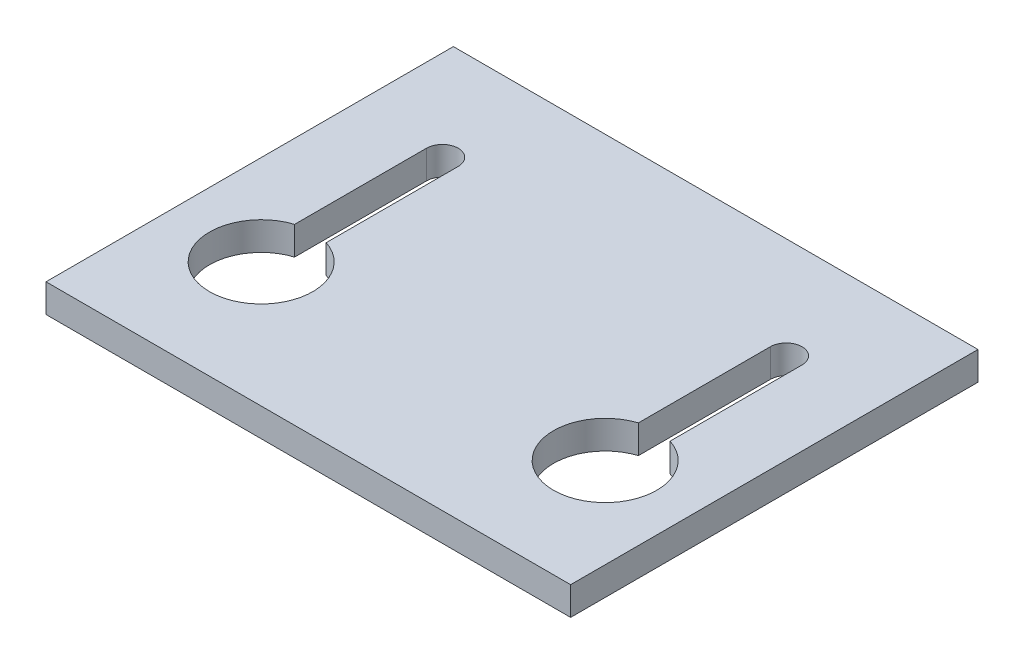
ISO-10303-21;
HEADER;
FILE_DESCRIPTION(('STEP AP214'),'2;1');
FILE_NAME('part.step','',(''),(''),'','','');
FILE_SCHEMA(('AUTOMOTIVE_DESIGN { 1 0 10303 214 1 1 1 1 }'));
ENDSEC;
DATA;
#1=APPLICATION_CONTEXT('core data for automotive mechanical design processes');
#2=APPLICATION_PROTOCOL_DEFINITION('international standard','automotive_design',2000,#1);
#3=PRODUCT_CONTEXT('',#1,'mechanical');
#4=PRODUCT('Part','Part','',(#3));
#5=PRODUCT_RELATED_PRODUCT_CATEGORY('part','',(#4));
#6=PRODUCT_DEFINITION_FORMATION('','',#4);
#7=PRODUCT_DEFINITION_CONTEXT('part definition',#1,'design');
#8=PRODUCT_DEFINITION('design','',#6,#7);
#9=PRODUCT_DEFINITION_SHAPE('','',#8);
#10=(LENGTH_UNIT() NAMED_UNIT(*) SI_UNIT(.MILLI.,.METRE.));
#11=(NAMED_UNIT(*) PLANE_ANGLE_UNIT() SI_UNIT($,.RADIAN.));
#12=(NAMED_UNIT(*) SI_UNIT($,.STERADIAN.) SOLID_ANGLE_UNIT());
#13=UNCERTAINTY_MEASURE_WITH_UNIT(LENGTH_MEASURE(1.E-05),#10,'distance_accuracy_value','');
#14=(GEOMETRIC_REPRESENTATION_CONTEXT(3) GLOBAL_UNCERTAINTY_ASSIGNED_CONTEXT((#13)) GLOBAL_UNIT_ASSIGNED_CONTEXT((#10,
#11,#12)) REPRESENTATION_CONTEXT('',''));
#15=CARTESIAN_POINT('',(0.,0.,0.));
#16=DIRECTION('',(0.,0.,1.));
#17=DIRECTION('',(1.,0.,0.));
#18=AXIS2_PLACEMENT_3D('',#15,#16,#17);
#19=CARTESIAN_POINT('',(0.,7.62,109.439882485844));
#20=DIRECTION('',(0.,1.,0.));
#21=DIRECTION('',(0.,0.,1.));
#22=AXIS2_PLACEMENT_3D('',#19,#20,#21);
#23=PLANE('',#22);
#24=DIRECTION('',(0.,0.,1.));
#25=VECTOR('',#24,1.);
#26=CARTESIAN_POINT('',(0.,7.62,0.));
#27=LINE('',#26,#25);
#28=CARTESIAN_POINT('',(0.,7.62,0.));
#29=VERTEX_POINT('',#28);
#30=CARTESIAN_POINT('',(0.,7.62,109.439882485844));
#31=VERTEX_POINT('',#30);
#32=EDGE_CURVE('E190',#29,#31,#27,.T.);
#33=ORIENTED_EDGE('',*,*,#32,.T.);
#34=DIRECTION('',(1.,0.,0.));
#35=VECTOR('',#34,1.);
#36=CARTESIAN_POINT('',(0.,7.62,109.439882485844));
#37=LINE('',#36,#35);
#38=CARTESIAN_POINT('',(140.940304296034,7.62,109.439882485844));
#39=VERTEX_POINT('',#38);
#40=EDGE_CURVE('E193',#31,#39,#37,.T.);
#41=ORIENTED_EDGE('',*,*,#40,.T.);
#42=DIRECTION('',(0.,0.,-1.));
#43=VECTOR('',#42,1.);
#44=CARTESIAN_POINT('',(140.940304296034,7.62,0.));
#45=LINE('',#44,#43);
#46=CARTESIAN_POINT('',(140.940304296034,7.62,0.));
#47=VERTEX_POINT('',#46);
#48=EDGE_CURVE('E195',#39,#47,#45,.T.);
#49=ORIENTED_EDGE('',*,*,#48,.T.);
#50=DIRECTION('',(-1.,0.,0.));
#51=VECTOR('',#50,1.);
#52=CARTESIAN_POINT('',(0.,7.62,0.));
#53=LINE('',#52,#51);
#54=EDGE_CURVE('E197',#47,#29,#53,.T.);
#55=ORIENTED_EDGE('',*,*,#54,.T.);
#56=EDGE_LOOP('',(#33,#41,#49,#55));
#57=FACE_BOUND('',#56,.T.);
#58=CARTESIAN_POINT('',(24.2843267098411,7.62,27.2480674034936));
#59=DIRECTION('',(0.,1.,0.));
#60=DIRECTION('',(0.,0.,1.));
#61=AXIS2_PLACEMENT_3D('',#58,#59,#60);
#62=CIRCLE('',#61,4.2538353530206);
#63=CARTESIAN_POINT('',(28.5381620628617,7.62,27.2480674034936));
#64=VERTEX_POINT('',#63);
#65=CARTESIAN_POINT('',(20.0304913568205,7.62,27.2480674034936));
#66=VERTEX_POINT('',#65);
#67=EDGE_CURVE('E147',#64,#66,#62,.T.);
#68=ORIENTED_EDGE('',*,*,#67,.F.);
#69=DIRECTION('',(0.,0.,-1.));
#70=VECTOR('',#69,1.);
#71=CARTESIAN_POINT('',(28.5381620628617,7.62,27.2480674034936));
#72=LINE('',#71,#70);
#73=CARTESIAN_POINT('',(28.5381620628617,7.62,62.7032263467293));
#74=VERTEX_POINT('',#73);
#75=EDGE_CURVE('E157',#74,#64,#72,.T.);
#76=ORIENTED_EDGE('',*,*,#75,.F.);
#77=CARTESIAN_POINT('',(24.2609183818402,7.62,75.9030018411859));
#78=DIRECTION('',(0.,1.,0.));
#79=DIRECTION('',(0.,0.,1.));
#80=AXIS2_PLACEMENT_3D('',#77,#78,#79);
#81=CIRCLE('',#80,13.8754778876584);
#82=CARTESIAN_POINT('',(20.0304913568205,7.62,62.688147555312));
#83=VERTEX_POINT('',#82);
#84=EDGE_CURVE('E154',#83,#74,#81,.T.);
#85=ORIENTED_EDGE('',*,*,#84,.F.);
#86=DIRECTION('',(0.,0.,1.));
#87=VECTOR('',#86,1.);
#88=CARTESIAN_POINT('',(20.0304913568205,7.62,27.2480674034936));
#89=LINE('',#88,#87);
#90=EDGE_CURVE('E151',#66,#83,#89,.T.);
#91=ORIENTED_EDGE('',*,*,#90,.F.);
#92=EDGE_LOOP('',(#68,#76,#85,#91));
#93=FACE_BOUND('',#92,.T.);
#94=DIRECTION('',(0.,0.,-1.));
#95=VECTOR('',#94,1.);
#96=CARTESIAN_POINT('',(112.402142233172,7.62,27.2480674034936));
#97=LINE('',#96,#95);
#98=CARTESIAN_POINT('',(112.402142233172,7.62,62.7032263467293));
#99=VERTEX_POINT('',#98);
#100=CARTESIAN_POINT('',(112.402142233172,7.62,27.2480674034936));
#101=VERTEX_POINT('',#100);
#102=EDGE_CURVE('E129',#99,#101,#97,.T.);
#103=ORIENTED_EDGE('',*,*,#102,.T.);
#104=CARTESIAN_POINT('',(116.655977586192,7.62,27.2480674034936));
#105=DIRECTION('',(0.,-1.,0.));
#106=DIRECTION('',(0.,0.,1.));
#107=AXIS2_PLACEMENT_3D('',#104,#105,#106);
#108=CIRCLE('',#107,4.2538353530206);
#109=CARTESIAN_POINT('',(120.909812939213,7.62,27.2480674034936));
#110=VERTEX_POINT('',#109);
#111=EDGE_CURVE('E42',#101,#110,#108,.T.);
#112=ORIENTED_EDGE('',*,*,#111,.T.);
#113=DIRECTION('',(0.,0.,1.));
#114=VECTOR('',#113,1.);
#115=CARTESIAN_POINT('',(120.909812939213,7.62,27.2480674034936));
#116=LINE('',#115,#114);
#117=CARTESIAN_POINT('',(120.909812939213,7.62,62.688147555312));
#118=VERTEX_POINT('',#117);
#119=EDGE_CURVE('E133',#110,#118,#116,.T.);
#120=ORIENTED_EDGE('',*,*,#119,.T.);
#121=CARTESIAN_POINT('',(116.679385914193,7.62,75.9030018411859));
#122=DIRECTION('',(0.,-1.,0.));
#123=DIRECTION('',(0.,0.,1.));
#124=AXIS2_PLACEMENT_3D('',#121,#122,#123);
#125=CIRCLE('',#124,13.8754778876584);
#126=EDGE_CURVE('E120',#118,#99,#125,.T.);
#127=ORIENTED_EDGE('',*,*,#126,.T.);
#128=EDGE_LOOP('',(#103,#112,#120,#127));
#129=FACE_BOUND('',#128,.T.);
#130=ADVANCED_FACE('F27',(#57,#93,#129),#23,.T.);
#131=CARTESIAN_POINT('',(0.,0.,109.439882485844));
#132=DIRECTION('',(0.,1.,0.));
#133=DIRECTION('',(0.,0.,1.));
#134=AXIS2_PLACEMENT_3D('',#131,#132,#133);
#135=PLANE('',#134);
#136=DIRECTION('',(0.,0.,1.));
#137=VECTOR('',#136,1.);
#138=CARTESIAN_POINT('',(0.,0.,0.));
#139=LINE('',#138,#137);
#140=CARTESIAN_POINT('',(0.,0.,0.));
#141=VERTEX_POINT('',#140);
#142=CARTESIAN_POINT('',(0.,0.,109.439882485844));
#143=VERTEX_POINT('',#142);
#144=EDGE_CURVE('E175',#141,#143,#139,.T.);
#145=ORIENTED_EDGE('',*,*,#144,.F.);
#146=DIRECTION('',(-1.,0.,0.));
#147=VECTOR('',#146,1.);
#148=CARTESIAN_POINT('',(0.,0.,0.));
#149=LINE('',#148,#147);
#150=CARTESIAN_POINT('',(140.940304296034,0.,0.));
#151=VERTEX_POINT('',#150);
#152=EDGE_CURVE('E188',#151,#141,#149,.T.);
#153=ORIENTED_EDGE('',*,*,#152,.F.);
#154=DIRECTION('',(0.,0.,-1.));
#155=VECTOR('',#154,1.);
#156=CARTESIAN_POINT('',(140.940304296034,0.,0.));
#157=LINE('',#156,#155);
#158=CARTESIAN_POINT('',(140.940304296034,0.,109.439882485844));
#159=VERTEX_POINT('',#158);
#160=EDGE_CURVE('E186',#159,#151,#157,.T.);
#161=ORIENTED_EDGE('',*,*,#160,.F.);
#162=DIRECTION('',(1.,0.,0.));
#163=VECTOR('',#162,1.);
#164=CARTESIAN_POINT('',(0.,0.,109.439882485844));
#165=LINE('',#164,#163);
#166=EDGE_CURVE('E184',#143,#159,#165,.T.);
#167=ORIENTED_EDGE('',*,*,#166,.F.);
#168=EDGE_LOOP('',(#145,#153,#161,#167));
#169=FACE_BOUND('',#168,.T.);
#170=DIRECTION('',(0.,0.,-1.));
#171=VECTOR('',#170,1.);
#172=CARTESIAN_POINT('',(28.5381620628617,0.,27.2480674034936));
#173=LINE('',#172,#171);
#174=CARTESIAN_POINT('',(28.5381620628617,0.,62.7032263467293));
#175=VERTEX_POINT('',#174);
#176=CARTESIAN_POINT('',(28.5381620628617,0.,27.2480674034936));
#177=VERTEX_POINT('',#176);
#178=EDGE_CURVE('E169',#175,#177,#173,.T.);
#179=ORIENTED_EDGE('',*,*,#178,.T.);
#180=CARTESIAN_POINT('',(24.2843267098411,0.,27.2480674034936));
#181=DIRECTION('',(0.,1.,0.));
#182=DIRECTION('',(0.,0.,1.));
#183=AXIS2_PLACEMENT_3D('',#180,#181,#182);
#184=CIRCLE('',#183,4.2538353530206);
#185=CARTESIAN_POINT('',(20.0304913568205,0.,27.2480674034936));
#186=VERTEX_POINT('',#185);
#187=EDGE_CURVE('E160',#177,#186,#184,.T.);
#188=ORIENTED_EDGE('',*,*,#187,.T.);
#189=DIRECTION('',(0.,0.,1.));
#190=VECTOR('',#189,1.);
#191=CARTESIAN_POINT('',(20.0304913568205,0.,27.2480674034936));
#192=LINE('',#191,#190);
#193=CARTESIAN_POINT('',(20.0304913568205,0.,62.688147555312));
#194=VERTEX_POINT('',#193);
#195=EDGE_CURVE('E163',#186,#194,#192,.T.);
#196=ORIENTED_EDGE('',*,*,#195,.T.);
#197=CARTESIAN_POINT('',(24.2609183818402,0.,75.9030018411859));
#198=DIRECTION('',(0.,1.,0.));
#199=DIRECTION('',(0.,0.,1.));
#200=AXIS2_PLACEMENT_3D('',#197,#198,#199);
#201=CIRCLE('',#200,13.8754778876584);
#202=EDGE_CURVE('E166',#194,#175,#201,.T.);
#203=ORIENTED_EDGE('',*,*,#202,.T.);
#204=EDGE_LOOP('',(#179,#188,#196,#203));
#205=FACE_BOUND('',#204,.T.);
#206=CARTESIAN_POINT('',(116.655977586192,0.,27.2480674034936));
#207=DIRECTION('',(0.,-1.,0.));
#208=DIRECTION('',(0.,0.,1.));
#209=AXIS2_PLACEMENT_3D('',#206,#207,#208);
#210=CIRCLE('',#209,4.2538353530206);
#211=CARTESIAN_POINT('',(112.402142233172,0.,27.2480674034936));
#212=VERTEX_POINT('',#211);
#213=CARTESIAN_POINT('',(120.909812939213,0.,27.2480674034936));
#214=VERTEX_POINT('',#213);
#215=EDGE_CURVE('E135',#212,#214,#210,.T.);
#216=ORIENTED_EDGE('',*,*,#215,.F.);
#217=DIRECTION('',(0.,0.,-1.));
#218=VECTOR('',#217,1.);
#219=CARTESIAN_POINT('',(112.402142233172,0.,27.2480674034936));
#220=LINE('',#219,#218);
#221=CARTESIAN_POINT('',(112.402142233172,0.,62.7032263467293));
#222=VERTEX_POINT('',#221);
#223=EDGE_CURVE('E140',#222,#212,#220,.T.);
#224=ORIENTED_EDGE('',*,*,#223,.F.);
#225=CARTESIAN_POINT('',(116.679385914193,0.,75.9030018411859));
#226=DIRECTION('',(0.,-1.,0.));
#227=DIRECTION('',(0.,0.,1.));
#228=AXIS2_PLACEMENT_3D('',#225,#226,#227);
#229=CIRCLE('',#228,13.8754778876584);
#230=CARTESIAN_POINT('',(120.909812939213,0.,62.688147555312));
#231=VERTEX_POINT('',#230);
#232=EDGE_CURVE('E123',#231,#222,#229,.T.);
#233=ORIENTED_EDGE('',*,*,#232,.F.);
#234=DIRECTION('',(0.,0.,1.));
#235=VECTOR('',#234,1.);
#236=CARTESIAN_POINT('',(120.909812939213,0.,27.2480674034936));
#237=LINE('',#236,#235);
#238=EDGE_CURVE('E143',#214,#231,#237,.T.);
#239=ORIENTED_EDGE('',*,*,#238,.F.);
#240=EDGE_LOOP('',(#216,#224,#233,#239));
#241=FACE_BOUND('',#240,.T.);
#242=ADVANCED_FACE('F215',(#169,#205,#241),#135,.F.);
#243=CARTESIAN_POINT('',(0.,7.62,0.));
#244=DIRECTION('',(1.,0.,0.));
#245=DIRECTION('',(0.,0.,-1.));
#246=AXIS2_PLACEMENT_3D('',#243,#244,#245);
#247=PLANE('',#246);
#248=ORIENTED_EDGE('',*,*,#144,.T.);
#249=DIRECTION('',(0.,-1.,0.));
#250=VECTOR('',#249,1.);
#251=CARTESIAN_POINT('',(0.,7.62,109.439882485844));
#252=LINE('',#251,#250);
#253=EDGE_CURVE('E11',#31,#143,#252,.T.);
#254=ORIENTED_EDGE('',*,*,#253,.F.);
#255=ORIENTED_EDGE('',*,*,#32,.F.);
#256=DIRECTION('',(0.,-1.,0.));
#257=VECTOR('',#256,1.);
#258=CARTESIAN_POINT('',(0.,7.62,0.));
#259=LINE('',#258,#257);
#260=EDGE_CURVE('E199',#29,#141,#259,.T.);
#261=ORIENTED_EDGE('',*,*,#260,.T.);
#262=EDGE_LOOP('',(#248,#254,#255,#261));
#263=FACE_BOUND('',#262,.T.);
#264=ADVANCED_FACE('F29',(#263),#247,.F.);
#265=CARTESIAN_POINT('',(0.,7.62,109.439882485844));
#266=DIRECTION('',(0.,0.,-1.));
#267=DIRECTION('',(-1.,0.,0.));
#268=AXIS2_PLACEMENT_3D('',#265,#266,#267);
#269=PLANE('',#268);
#270=ORIENTED_EDGE('',*,*,#166,.T.);
#271=DIRECTION('',(0.,-1.,0.));
#272=VECTOR('',#271,1.);
#273=CARTESIAN_POINT('',(140.940304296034,7.62,109.439882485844));
#274=LINE('',#273,#272);
#275=EDGE_CURVE('E35',#39,#159,#274,.T.);
#276=ORIENTED_EDGE('',*,*,#275,.F.);
#277=ORIENTED_EDGE('',*,*,#40,.F.);
#278=ORIENTED_EDGE('',*,*,#253,.T.);
#279=EDGE_LOOP('',(#270,#276,#277,#278));
#280=FACE_BOUND('',#279,.T.);
#281=ADVANCED_FACE('F226',(#280),#269,.F.);
#282=CARTESIAN_POINT('',(140.940304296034,7.62,0.));
#283=DIRECTION('',(-1.,0.,0.));
#284=DIRECTION('',(0.,0.,1.));
#285=AXIS2_PLACEMENT_3D('',#282,#283,#284);
#286=PLANE('',#285);
#287=ORIENTED_EDGE('',*,*,#160,.T.);
#288=DIRECTION('',(0.,-1.,0.));
#289=VECTOR('',#288,1.);
#290=CARTESIAN_POINT('',(140.940304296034,7.62,0.));
#291=LINE('',#290,#289);
#292=EDGE_CURVE('E202',#47,#151,#291,.T.);
#293=ORIENTED_EDGE('',*,*,#292,.F.);
#294=ORIENTED_EDGE('',*,*,#48,.F.);
#295=ORIENTED_EDGE('',*,*,#275,.T.);
#296=EDGE_LOOP('',(#287,#293,#294,#295));
#297=FACE_BOUND('',#296,.T.);
#298=ADVANCED_FACE('F209',(#297),#286,.F.);
#299=CARTESIAN_POINT('',(0.,7.62,0.));
#300=DIRECTION('',(0.,0.,1.));
#301=DIRECTION('',(1.,0.,0.));
#302=AXIS2_PLACEMENT_3D('',#299,#300,#301);
#303=PLANE('',#302);
#304=ORIENTED_EDGE('',*,*,#152,.T.);
#305=ORIENTED_EDGE('',*,*,#260,.F.);
#306=ORIENTED_EDGE('',*,*,#54,.F.);
#307=ORIENTED_EDGE('',*,*,#292,.T.);
#308=EDGE_LOOP('',(#304,#305,#306,#307));
#309=FACE_BOUND('',#308,.T.);
#310=ADVANCED_FACE('F219',(#309),#303,.F.);
#311=CARTESIAN_POINT('',(24.2843267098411,0.,27.2480674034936));
#312=DIRECTION('',(0.,1.,0.));
#313=DIRECTION('',(0.,0.,1.));
#314=AXIS2_PLACEMENT_3D('',#311,#312,#313);
#315=CYLINDRICAL_SURFACE('',#314,4.2538353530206);
#316=ORIENTED_EDGE('',*,*,#67,.T.);
#317=DIRECTION('',(0.,1.,0.));
#318=VECTOR('',#317,1.);
#319=CARTESIAN_POINT('',(20.0304913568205,0.,27.2480674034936));
#320=LINE('',#319,#318);
#321=EDGE_CURVE('E172',#186,#66,#320,.T.);
#322=ORIENTED_EDGE('',*,*,#321,.F.);
#323=ORIENTED_EDGE('',*,*,#187,.F.);
#324=DIRECTION('',(0.,1.,0.));
#325=VECTOR('',#324,1.);
#326=CARTESIAN_POINT('',(28.5381620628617,0.,27.2480674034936));
#327=LINE('',#326,#325);
#328=EDGE_CURVE('E173',#177,#64,#327,.T.);
#329=ORIENTED_EDGE('',*,*,#328,.T.);
#330=EDGE_LOOP('',(#316,#322,#323,#329));
#331=FACE_BOUND('',#330,.T.);
#332=ADVANCED_FACE('F243',(#331),#315,.F.);
#333=CARTESIAN_POINT('',(28.5381620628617,0.,27.2480674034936));
#334=DIRECTION('',(1.,0.,0.));
#335=DIRECTION('',(0.,0.,-1.));
#336=AXIS2_PLACEMENT_3D('',#333,#334,#335);
#337=PLANE('',#336);
#338=ORIENTED_EDGE('',*,*,#75,.T.);
#339=ORIENTED_EDGE('',*,*,#328,.F.);
#340=ORIENTED_EDGE('',*,*,#178,.F.);
#341=DIRECTION('',(0.,1.,0.));
#342=VECTOR('',#341,1.);
#343=CARTESIAN_POINT('',(28.5381620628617,0.,62.7032263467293));
#344=LINE('',#343,#342);
#345=EDGE_CURVE('E176',#175,#74,#344,.T.);
#346=ORIENTED_EDGE('',*,*,#345,.T.);
#347=EDGE_LOOP('',(#338,#339,#340,#346));
#348=FACE_BOUND('',#347,.T.);
#349=ADVANCED_FACE('F247',(#348),#337,.F.);
#350=CARTESIAN_POINT('',(24.2609183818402,0.,75.9030018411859));
#351=DIRECTION('',(0.,1.,0.));
#352=DIRECTION('',(0.,0.,1.));
#353=AXIS2_PLACEMENT_3D('',#350,#351,#352);
#354=CYLINDRICAL_SURFACE('',#353,13.8754778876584);
#355=ORIENTED_EDGE('',*,*,#84,.T.);
#356=ORIENTED_EDGE('',*,*,#345,.F.);
#357=ORIENTED_EDGE('',*,*,#202,.F.);
#358=DIRECTION('',(0.,1.,0.));
#359=VECTOR('',#358,1.);
#360=CARTESIAN_POINT('',(20.0304913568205,0.,62.688147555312));
#361=LINE('',#360,#359);
#362=EDGE_CURVE('E178',#194,#83,#361,.T.);
#363=ORIENTED_EDGE('',*,*,#362,.T.);
#364=EDGE_LOOP('',(#355,#356,#357,#363));
#365=FACE_BOUND('',#364,.T.);
#366=ADVANCED_FACE('F252',(#365),#354,.F.);
#367=CARTESIAN_POINT('',(20.0304913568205,0.,27.2480674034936));
#368=DIRECTION('',(-1.,0.,0.));
#369=DIRECTION('',(0.,0.,1.));
#370=AXIS2_PLACEMENT_3D('',#367,#368,#369);
#371=PLANE('',#370);
#372=ORIENTED_EDGE('',*,*,#90,.T.);
#373=ORIENTED_EDGE('',*,*,#362,.F.);
#374=ORIENTED_EDGE('',*,*,#195,.F.);
#375=ORIENTED_EDGE('',*,*,#321,.T.);
#376=EDGE_LOOP('',(#372,#373,#374,#375));
#377=FACE_BOUND('',#376,.T.);
#378=ADVANCED_FACE('F256',(#377),#371,.F.);
#379=CARTESIAN_POINT('',(116.655977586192,0.,27.2480674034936));
#380=DIRECTION('',(0.,1.,0.));
#381=DIRECTION('',(0.,0.,1.));
#382=AXIS2_PLACEMENT_3D('',#379,#380,#381);
#383=CYLINDRICAL_SURFACE('',#382,4.2538353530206);
#384=ORIENTED_EDGE('',*,*,#111,.F.);
#385=DIRECTION('',(0.,1.,0.));
#386=VECTOR('',#385,1.);
#387=CARTESIAN_POINT('',(112.402142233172,0.,27.2480674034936));
#388=LINE('',#387,#386);
#389=EDGE_CURVE('E126',#212,#101,#388,.T.);
#390=ORIENTED_EDGE('',*,*,#389,.F.);
#391=ORIENTED_EDGE('',*,*,#215,.T.);
#392=DIRECTION('',(0.,1.,0.));
#393=VECTOR('',#392,1.);
#394=CARTESIAN_POINT('',(120.909812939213,0.,27.2480674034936));
#395=LINE('',#394,#393);
#396=EDGE_CURVE('E145',#214,#110,#395,.T.);
#397=ORIENTED_EDGE('',*,*,#396,.T.);
#398=EDGE_LOOP('',(#384,#390,#391,#397));
#399=FACE_BOUND('',#398,.T.);
#400=ADVANCED_FACE('F258',(#399),#383,.F.);
#401=CARTESIAN_POINT('',(120.909812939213,0.,27.2480674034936));
#402=DIRECTION('',(-1.,0.,0.));
#403=DIRECTION('',(0.,0.,1.));
#404=AXIS2_PLACEMENT_3D('',#401,#402,#403);
#405=PLANE('',#404);
#406=ORIENTED_EDGE('',*,*,#119,.F.);
#407=ORIENTED_EDGE('',*,*,#396,.F.);
#408=ORIENTED_EDGE('',*,*,#238,.T.);
#409=DIRECTION('',(0.,1.,0.));
#410=VECTOR('',#409,1.);
#411=CARTESIAN_POINT('',(120.909812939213,0.,62.688147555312));
#412=LINE('',#411,#410);
#413=EDGE_CURVE('E125',#231,#118,#412,.T.);
#414=ORIENTED_EDGE('',*,*,#413,.T.);
#415=EDGE_LOOP('',(#406,#407,#408,#414));
#416=FACE_BOUND('',#415,.T.);
#417=ADVANCED_FACE('F265',(#416),#405,.T.);
#418=CARTESIAN_POINT('',(116.679385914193,0.,75.9030018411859));
#419=DIRECTION('',(0.,1.,0.));
#420=DIRECTION('',(0.,0.,1.));
#421=AXIS2_PLACEMENT_3D('',#418,#419,#420);
#422=CYLINDRICAL_SURFACE('',#421,13.8754778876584);
#423=ORIENTED_EDGE('',*,*,#126,.F.);
#424=ORIENTED_EDGE('',*,*,#413,.F.);
#425=ORIENTED_EDGE('',*,*,#232,.T.);
#426=DIRECTION('',(0.,1.,0.));
#427=VECTOR('',#426,1.);
#428=CARTESIAN_POINT('',(112.402142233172,0.,62.7032263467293));
#429=LINE('',#428,#427);
#430=EDGE_CURVE('E50',#222,#99,#429,.T.);
#431=ORIENTED_EDGE('',*,*,#430,.T.);
#432=EDGE_LOOP('',(#423,#424,#425,#431));
#433=FACE_BOUND('',#432,.T.);
#434=ADVANCED_FACE('F117',(#433),#422,.F.);
#435=CARTESIAN_POINT('',(112.402142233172,0.,27.2480674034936));
#436=DIRECTION('',(1.,0.,0.));
#437=DIRECTION('',(0.,0.,-1.));
#438=AXIS2_PLACEMENT_3D('',#435,#436,#437);
#439=PLANE('',#438);
#440=ORIENTED_EDGE('',*,*,#102,.F.);
#441=ORIENTED_EDGE('',*,*,#430,.F.);
#442=ORIENTED_EDGE('',*,*,#223,.T.);
#443=ORIENTED_EDGE('',*,*,#389,.T.);
#444=EDGE_LOOP('',(#440,#441,#442,#443));
#445=FACE_BOUND('',#444,.T.);
#446=ADVANCED_FACE('F130',(#445),#439,.T.);
#447=CLOSED_SHELL('',(#130,#242,#264,#281,#298,#310,#332,#349,#366,#378,#400,#417,#434,#446));
#448=MANIFOLD_SOLID_BREP('B2',#447);
#449=ADVANCED_BREP_SHAPE_REPRESENTATION('',(#18,#448),#14);
#450=SHAPE_DEFINITION_REPRESENTATION(#9,#449);
ENDSEC;
END-ISO-10303-21;
